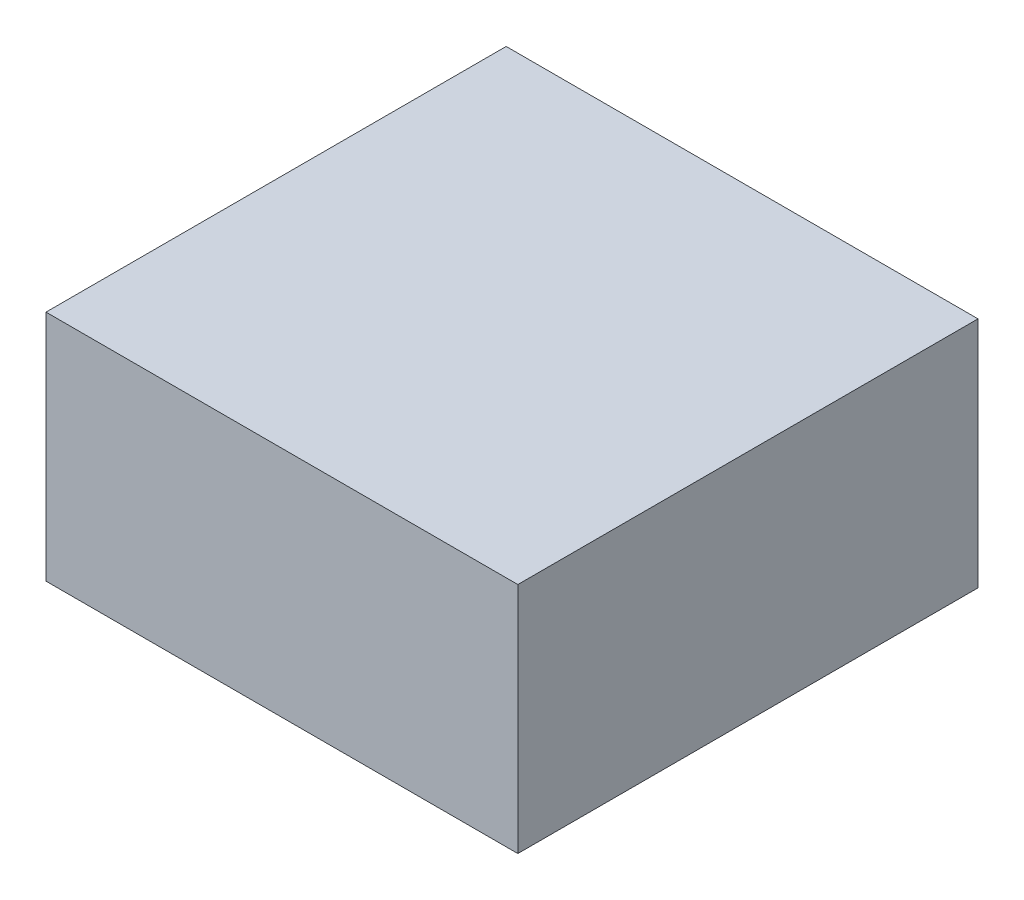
ISO-10303-21;
HEADER;
FILE_DESCRIPTION(('STEP AP214'),'2;1');
FILE_NAME('part.step','',(''),(''),'','','');
FILE_SCHEMA(('AUTOMOTIVE_DESIGN { 1 0 10303 214 1 1 1 1 }'));
ENDSEC;
DATA;
#1=APPLICATION_CONTEXT('core data for automotive mechanical design processes');
#2=APPLICATION_PROTOCOL_DEFINITION('international standard','automotive_design',2000,#1);
#3=PRODUCT_CONTEXT('',#1,'mechanical');
#4=PRODUCT('Part','Part','',(#3));
#5=PRODUCT_RELATED_PRODUCT_CATEGORY('part','',(#4));
#6=PRODUCT_DEFINITION_FORMATION('','',#4);
#7=PRODUCT_DEFINITION_CONTEXT('part definition',#1,'design');
#8=PRODUCT_DEFINITION('design','',#6,#7);
#9=PRODUCT_DEFINITION_SHAPE('','',#8);
#10=(LENGTH_UNIT() NAMED_UNIT(*) SI_UNIT(.MILLI.,.METRE.));
#11=(NAMED_UNIT(*) PLANE_ANGLE_UNIT() SI_UNIT($,.RADIAN.));
#12=(NAMED_UNIT(*) SI_UNIT($,.STERADIAN.) SOLID_ANGLE_UNIT());
#13=UNCERTAINTY_MEASURE_WITH_UNIT(LENGTH_MEASURE(1.E-05),#10,'distance_accuracy_value','');
#14=(GEOMETRIC_REPRESENTATION_CONTEXT(3) GLOBAL_UNCERTAINTY_ASSIGNED_CONTEXT((#13)) GLOBAL_UNIT_ASSIGNED_CONTEXT((#10,
#11,#12)) REPRESENTATION_CONTEXT('',''));
#15=CARTESIAN_POINT('',(0.,0.,0.));
#16=DIRECTION('',(0.,0.,1.));
#17=DIRECTION('',(1.,0.,0.));
#18=AXIS2_PLACEMENT_3D('',#15,#16,#17);
#19=CARTESIAN_POINT('',(-10.,-10.,39.5));
#20=DIRECTION('',(1.,0.,0.));
#21=DIRECTION('',(0.,0.,-1.));
#22=AXIS2_PLACEMENT_3D('',#19,#20,#21);
#23=PLANE('',#22);
#24=DIRECTION('',(0.,-1.,0.));
#25=VECTOR('',#24,1.);
#26=CARTESIAN_POINT('',(-10.,-10.,0.));
#27=LINE('',#26,#25);
#28=CARTESIAN_POINT('',(-10.,10.,0.));
#29=VERTEX_POINT('',#28);
#30=CARTESIAN_POINT('',(-10.,-10.,0.));
#31=VERTEX_POINT('',#30);
#32=EDGE_CURVE('E105',#29,#31,#27,.T.);
#33=ORIENTED_EDGE('',*,*,#32,.T.);
#34=DIRECTION('',(0.,0.,-1.));
#35=VECTOR('',#34,1.);
#36=CARTESIAN_POINT('',(-10.,-10.,39.5));
#37=LINE('',#36,#35);
#38=CARTESIAN_POINT('',(-10.,-10.,39.5));
#39=VERTEX_POINT('',#38);
#40=EDGE_CURVE('E11',#39,#31,#37,.T.);
#41=ORIENTED_EDGE('',*,*,#40,.F.);
#42=DIRECTION('',(0.,-1.,0.));
#43=VECTOR('',#42,1.);
#44=CARTESIAN_POINT('',(-10.,-10.,39.5));
#45=LINE('',#44,#43);
#46=CARTESIAN_POINT('',(-10.,10.,39.5));
#47=VERTEX_POINT('',#46);
#48=EDGE_CURVE('E89',#47,#39,#45,.T.);
#49=ORIENTED_EDGE('',*,*,#48,.F.);
#50=DIRECTION('',(0.,0.,-1.));
#51=VECTOR('',#50,1.);
#52=CARTESIAN_POINT('',(-10.,10.,39.5));
#53=LINE('',#52,#51);
#54=EDGE_CURVE('E98',#47,#29,#53,.T.);
#55=ORIENTED_EDGE('',*,*,#54,.T.);
#56=EDGE_LOOP('',(#33,#41,#49,#55));
#57=FACE_BOUND('',#56,.T.);
#58=ADVANCED_FACE('F39',(#57),#23,.F.);
#59=CARTESIAN_POINT('',(-10.,-10.,39.5));
#60=DIRECTION('',(0.,1.,0.));
#61=DIRECTION('',(0.,0.,1.));
#62=AXIS2_PLACEMENT_3D('',#59,#60,#61);
#63=PLANE('',#62);
#64=DIRECTION('',(1.,0.,0.));
#65=VECTOR('',#64,1.);
#66=CARTESIAN_POINT('',(-10.,-10.,0.));
#67=LINE('',#66,#65);
#68=CARTESIAN_POINT('',(30.5,-10.,0.));
#69=VERTEX_POINT('',#68);
#70=EDGE_CURVE('E94',#31,#69,#67,.T.);
#71=ORIENTED_EDGE('',*,*,#70,.T.);
#72=DIRECTION('',(0.,0.,-1.));
#73=VECTOR('',#72,1.);
#74=CARTESIAN_POINT('',(30.5,-10.,39.5));
#75=LINE('',#74,#73);
#76=CARTESIAN_POINT('',(30.5,-10.,39.5));
#77=VERTEX_POINT('',#76);
#78=EDGE_CURVE('E50',#77,#69,#75,.T.);
#79=ORIENTED_EDGE('',*,*,#78,.F.);
#80=DIRECTION('',(1.,0.,0.));
#81=VECTOR('',#80,1.);
#82=CARTESIAN_POINT('',(-10.,-10.,39.5));
#83=LINE('',#82,#81);
#84=EDGE_CURVE('E83',#39,#77,#83,.T.);
#85=ORIENTED_EDGE('',*,*,#84,.F.);
#86=ORIENTED_EDGE('',*,*,#40,.T.);
#87=EDGE_LOOP('',(#71,#79,#85,#86));
#88=FACE_BOUND('',#87,.T.);
#89=ADVANCED_FACE('F91',(#88),#63,.F.);
#90=CARTESIAN_POINT('',(30.5,-10.,39.5));
#91=DIRECTION('',(-1.,0.,0.));
#92=DIRECTION('',(0.,0.,1.));
#93=AXIS2_PLACEMENT_3D('',#90,#91,#92);
#94=PLANE('',#93);
#95=DIRECTION('',(0.,1.,0.));
#96=VECTOR('',#95,1.);
#97=CARTESIAN_POINT('',(30.5,-10.,0.));
#98=LINE('',#97,#96);
#99=CARTESIAN_POINT('',(30.5,10.,0.));
#100=VERTEX_POINT('',#99);
#101=EDGE_CURVE('E75',#69,#100,#98,.T.);
#102=ORIENTED_EDGE('',*,*,#101,.T.);
#103=DIRECTION('',(0.,0.,-1.));
#104=VECTOR('',#103,1.);
#105=CARTESIAN_POINT('',(30.5,10.,39.5));
#106=LINE('',#105,#104);
#107=CARTESIAN_POINT('',(30.5,10.,39.5));
#108=VERTEX_POINT('',#107);
#109=EDGE_CURVE('E92',#108,#100,#106,.T.);
#110=ORIENTED_EDGE('',*,*,#109,.F.);
#111=DIRECTION('',(0.,1.,0.));
#112=VECTOR('',#111,1.);
#113=CARTESIAN_POINT('',(30.5,-10.,39.5));
#114=LINE('',#113,#112);
#115=EDGE_CURVE('E86',#77,#108,#114,.T.);
#116=ORIENTED_EDGE('',*,*,#115,.F.);
#117=ORIENTED_EDGE('',*,*,#78,.T.);
#118=EDGE_LOOP('',(#102,#110,#116,#117));
#119=FACE_BOUND('',#118,.T.);
#120=ADVANCED_FACE('F96',(#119),#94,.F.);
#121=CARTESIAN_POINT('',(-10.,10.,39.5));
#122=DIRECTION('',(0.,-1.,0.));
#123=DIRECTION('',(0.,0.,-1.));
#124=AXIS2_PLACEMENT_3D('',#121,#122,#123);
#125=PLANE('',#124);
#126=DIRECTION('',(-1.,0.,0.));
#127=VECTOR('',#126,1.);
#128=CARTESIAN_POINT('',(-10.,10.,0.));
#129=LINE('',#128,#127);
#130=EDGE_CURVE('E77',#100,#29,#129,.T.);
#131=ORIENTED_EDGE('',*,*,#130,.T.);
#132=ORIENTED_EDGE('',*,*,#54,.F.);
#133=DIRECTION('',(-1.,0.,0.));
#134=VECTOR('',#133,1.);
#135=CARTESIAN_POINT('',(-10.,10.,39.5));
#136=LINE('',#135,#134);
#137=EDGE_CURVE('E54',#108,#47,#136,.T.);
#138=ORIENTED_EDGE('',*,*,#137,.F.);
#139=ORIENTED_EDGE('',*,*,#109,.T.);
#140=EDGE_LOOP('',(#131,#132,#138,#139));
#141=FACE_BOUND('',#140,.T.);
#142=ADVANCED_FACE('F108',(#141),#125,.F.);
#143=CARTESIAN_POINT('',(0.,0.,39.5));
#144=DIRECTION('',(0.,0.,-1.));
#145=DIRECTION('',(-1.,0.,0.));
#146=AXIS2_PLACEMENT_3D('',#143,#144,#145);
#147=PLANE('',#146);
#148=ORIENTED_EDGE('',*,*,#48,.T.);
#149=ORIENTED_EDGE('',*,*,#84,.T.);
#150=ORIENTED_EDGE('',*,*,#115,.T.);
#151=ORIENTED_EDGE('',*,*,#137,.T.);
#152=EDGE_LOOP('',(#148,#149,#150,#151));
#153=FACE_BOUND('',#152,.T.);
#154=ADVANCED_FACE('F88',(#153),#147,.F.);
#155=CARTESIAN_POINT('',(0.,0.,0.));
#156=DIRECTION('',(0.,0.,-1.));
#157=DIRECTION('',(-1.,0.,0.));
#158=AXIS2_PLACEMENT_3D('',#155,#156,#157);
#159=PLANE('',#158);
#160=ORIENTED_EDGE('',*,*,#32,.F.);
#161=ORIENTED_EDGE('',*,*,#130,.F.);
#162=ORIENTED_EDGE('',*,*,#101,.F.);
#163=ORIENTED_EDGE('',*,*,#70,.F.);
#164=EDGE_LOOP('',(#160,#161,#162,#163));
#165=FACE_BOUND('',#164,.T.);
#166=ADVANCED_FACE('F115',(#165),#159,.T.);
#167=CLOSED_SHELL('',(#58,#89,#120,#142,#154,#166));
#168=MANIFOLD_SOLID_BREP('B2',#167);
#169=ADVANCED_BREP_SHAPE_REPRESENTATION('',(#18,#168),#14);
#170=SHAPE_DEFINITION_REPRESENTATION(#9,#169);
ENDSEC;
END-ISO-10303-21;
